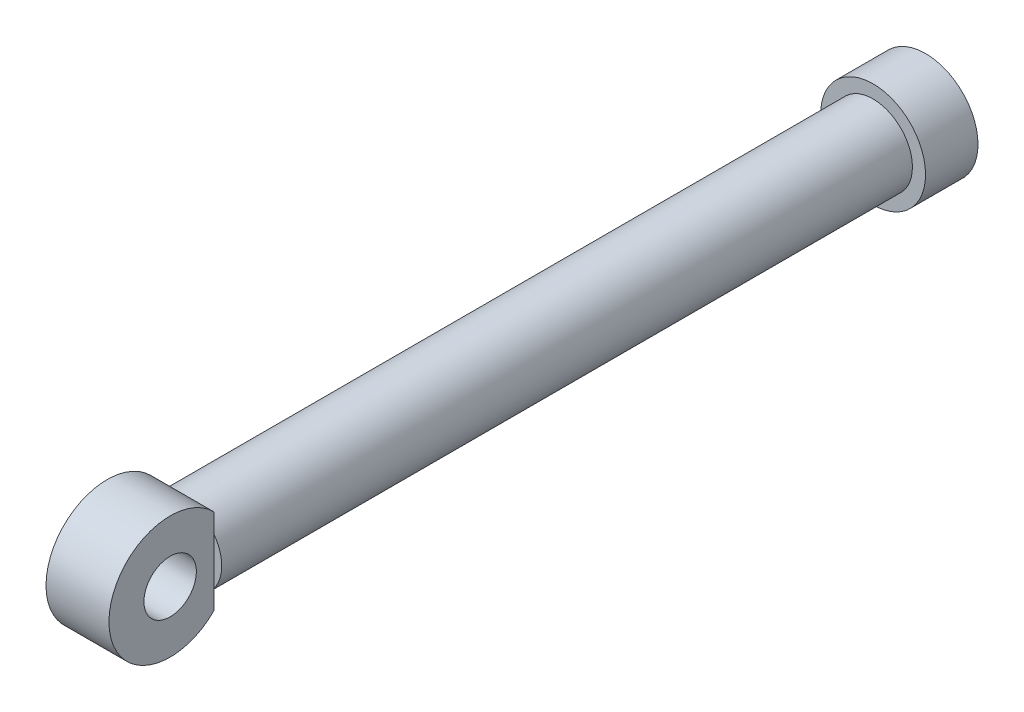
ISO-10303-21;
HEADER;
FILE_DESCRIPTION(('STEP AP214'),'2;1');
FILE_NAME('part.step','',(''),(''),'','','');
FILE_SCHEMA(('AUTOMOTIVE_DESIGN { 1 0 10303 214 1 1 1 1 }'));
ENDSEC;
DATA;
#1=APPLICATION_CONTEXT('core data for automotive mechanical design processes');
#2=APPLICATION_PROTOCOL_DEFINITION('international standard','automotive_design',2000,#1);
#3=PRODUCT_CONTEXT('',#1,'mechanical');
#4=PRODUCT('Part','Part','',(#3));
#5=PRODUCT_RELATED_PRODUCT_CATEGORY('part','',(#4));
#6=PRODUCT_DEFINITION_FORMATION('','',#4);
#7=PRODUCT_DEFINITION_CONTEXT('part definition',#1,'design');
#8=PRODUCT_DEFINITION('design','',#6,#7);
#9=PRODUCT_DEFINITION_SHAPE('','',#8);
#10=(LENGTH_UNIT() NAMED_UNIT(*) SI_UNIT(.MILLI.,.METRE.));
#11=(NAMED_UNIT(*) PLANE_ANGLE_UNIT() SI_UNIT($,.RADIAN.));
#12=(NAMED_UNIT(*) SI_UNIT($,.STERADIAN.) SOLID_ANGLE_UNIT());
#13=UNCERTAINTY_MEASURE_WITH_UNIT(LENGTH_MEASURE(1.E-05),#10,'distance_accuracy_value','');
#14=(GEOMETRIC_REPRESENTATION_CONTEXT(3) GLOBAL_UNCERTAINTY_ASSIGNED_CONTEXT((#13)) GLOBAL_UNIT_ASSIGNED_CONTEXT((#10,
#11,#12)) REPRESENTATION_CONTEXT('',''));
#15=CARTESIAN_POINT('',(0.,0.,0.));
#16=DIRECTION('',(0.,0.,1.));
#17=DIRECTION('',(1.,0.,0.));
#18=AXIS2_PLACEMENT_3D('',#15,#16,#17);
#19=CARTESIAN_POINT('',(0.,0.,425.));
#20=DIRECTION('',(0.,0.,1.));
#21=DIRECTION('',(1.,0.,0.));
#22=AXIS2_PLACEMENT_3D('',#19,#20,#21);
#23=PLANE('',#22);
#24=CARTESIAN_POINT('',(0.,0.,425.));
#25=DIRECTION('',(0.,0.,1.));
#26=DIRECTION('',(1.,0.,0.));
#27=AXIS2_PLACEMENT_3D('',#24,#25,#26);
#28=CIRCLE('',#27,22.5);
#29=CARTESIAN_POINT('',(-18.,13.5,425.));
#30=VERTEX_POINT('',#29);
#31=CARTESIAN_POINT('',(-18.,-13.5,425.));
#32=VERTEX_POINT('',#31);
#33=EDGE_CURVE('E117',#30,#32,#28,.T.);
#34=ORIENTED_EDGE('',*,*,#33,.T.);
#35=DIRECTION('',(0.,1.,0.));
#36=VECTOR('',#35,1.);
#37=CARTESIAN_POINT('',(-18.,0.,425.));
#38=LINE('',#37,#36);
#39=EDGE_CURVE('E47',#32,#30,#38,.T.);
#40=ORIENTED_EDGE('',*,*,#39,.T.);
#41=EDGE_LOOP('',(#34,#40));
#42=FACE_BOUND('',#41,.T.);
#43=ADVANCED_FACE('F39',(#42),#23,.T.);
#44=CARTESIAN_POINT('',(0.,0.,30.));
#45=DIRECTION('',(0.,0.,1.));
#46=DIRECTION('',(1.,0.,0.));
#47=AXIS2_PLACEMENT_3D('',#44,#45,#46);
#48=PLANE('',#47);
#49=CARTESIAN_POINT('',(0.,0.,30.));
#50=DIRECTION('',(0.,0.,1.));
#51=DIRECTION('',(1.,0.,0.));
#52=AXIS2_PLACEMENT_3D('',#49,#50,#51);
#53=CIRCLE('',#52,30.);
#54=CARTESIAN_POINT('',(30.,0.,30.));
#55=VERTEX_POINT('',#54);
#56=EDGE_CURVE('E120',#55,#55,#53,.T.);
#57=ORIENTED_EDGE('',*,*,#56,.T.);
#58=EDGE_LOOP('',(#57));
#59=FACE_BOUND('',#58,.T.);
#60=CARTESIAN_POINT('',(0.,0.,30.));
#61=DIRECTION('',(0.,0.,1.));
#62=DIRECTION('',(1.,0.,0.));
#63=AXIS2_PLACEMENT_3D('',#60,#61,#62);
#64=CIRCLE('',#63,22.5);
#65=CARTESIAN_POINT('',(22.5,0.,30.));
#66=VERTEX_POINT('',#65);
#67=EDGE_CURVE('E96',#66,#66,#64,.T.);
#68=ORIENTED_EDGE('',*,*,#67,.F.);
#69=EDGE_LOOP('',(#68));
#70=FACE_BOUND('',#69,.T.);
#71=ADVANCED_FACE('F149',(#59,#70),#48,.T.);
#72=CARTESIAN_POINT('',(0.,0.,30.));
#73=DIRECTION('',(0.,0.,-1.));
#74=DIRECTION('',(-1.,0.,0.));
#75=AXIS2_PLACEMENT_3D('',#72,#73,#74);
#76=CYLINDRICAL_SURFACE('',#75,30.);
#77=ORIENTED_EDGE('',*,*,#56,.F.);
#78=EDGE_LOOP('',(#77));
#79=FACE_BOUND('',#78,.T.);
#80=CARTESIAN_POINT('',(0.,0.,0.));
#81=DIRECTION('',(0.,0.,1.));
#82=DIRECTION('',(1.,0.,0.));
#83=AXIS2_PLACEMENT_3D('',#80,#81,#82);
#84=CIRCLE('',#83,30.);
#85=CARTESIAN_POINT('',(30.,0.,0.));
#86=VERTEX_POINT('',#85);
#87=EDGE_CURVE('E116',#86,#86,#84,.T.);
#88=ORIENTED_EDGE('',*,*,#87,.T.);
#89=EDGE_LOOP('',(#88));
#90=FACE_BOUND('',#89,.T.);
#91=ADVANCED_FACE('F41',(#79,#90),#76,.T.);
#92=CARTESIAN_POINT('',(0.,0.,0.));
#93=DIRECTION('',(0.,0.,1.));
#94=DIRECTION('',(1.,0.,0.));
#95=AXIS2_PLACEMENT_3D('',#92,#93,#94);
#96=PLANE('',#95);
#97=ORIENTED_EDGE('',*,*,#87,.F.);
#98=EDGE_LOOP('',(#97));
#99=FACE_BOUND('',#98,.T.);
#100=ADVANCED_FACE('F157',(#99),#96,.F.);
#101=CARTESIAN_POINT('',(0.,0.,425.));
#102=DIRECTION('',(0.,0.,-1.));
#103=DIRECTION('',(-1.,0.,0.));
#104=AXIS2_PLACEMENT_3D('',#101,#102,#103);
#105=CYLINDRICAL_SURFACE('',#104,22.5);
#106=CARTESIAN_POINT('',(18.,13.5,425.));
#107=VERTEX_POINT('',#106);
#108=EDGE_CURVE('E114',#107,#30,#28,.T.);
#109=ORIENTED_EDGE('',*,*,#108,.F.);
#110=CARTESIAN_POINT('',(18.,-13.5,425.));
#111=VERTEX_POINT('',#110);
#112=EDGE_CURVE('E113',#111,#107,#28,.T.);
#113=ORIENTED_EDGE('',*,*,#112,.F.);
#114=EDGE_CURVE('E130',#32,#111,#28,.T.);
#115=ORIENTED_EDGE('',*,*,#114,.F.);
#116=ORIENTED_EDGE('',*,*,#33,.F.);
#117=EDGE_LOOP('',(#109,#113,#115,#116));
#118=FACE_BOUND('',#117,.T.);
#119=ORIENTED_EDGE('',*,*,#67,.T.);
#120=EDGE_LOOP('',(#119));
#121=FACE_BOUND('',#120,.T.);
#122=ADVANCED_FACE('F127',(#118,#121),#105,.T.);
#123=DIRECTION('',(0.,1.,0.));
#124=VECTOR('',#123,1.);
#125=CARTESIAN_POINT('',(18.,0.,425.));
#126=LINE('',#125,#124);
#127=EDGE_CURVE('E11',#111,#107,#126,.T.);
#128=ORIENTED_EDGE('',*,*,#127,.F.);
#129=ORIENTED_EDGE('',*,*,#112,.T.);
#130=EDGE_LOOP('',(#128,#129));
#131=FACE_BOUND('',#130,.T.);
#132=ADVANCED_FACE('F134',(#131),#23,.T.);
#133=CARTESIAN_POINT('',(18.,24.4948974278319,425.));
#134=DIRECTION('',(0.,0.,1.));
#135=DIRECTION('',(1.,0.,0.));
#136=AXIS2_PLACEMENT_3D('',#133,#134,#135);
#137=PLANE('',#136);
#138=DIRECTION('',(0.,1.,0.));
#139=VECTOR('',#138,1.);
#140=CARTESIAN_POINT('',(18.,24.4948974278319,425.));
#141=LINE('',#140,#139);
#142=CARTESIAN_POINT('',(18.,24.4948974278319,425.));
#143=VERTEX_POINT('',#142);
#144=EDGE_CURVE('E61',#107,#143,#141,.T.);
#145=ORIENTED_EDGE('',*,*,#144,.F.);
#146=ORIENTED_EDGE('',*,*,#108,.T.);
#147=DIRECTION('',(0.,1.,0.));
#148=VECTOR('',#147,1.);
#149=CARTESIAN_POINT('',(-18.,24.4948974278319,425.));
#150=LINE('',#149,#148);
#151=CARTESIAN_POINT('',(-18.,24.4948974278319,425.));
#152=VERTEX_POINT('',#151);
#153=EDGE_CURVE('E54',#30,#152,#150,.T.);
#154=ORIENTED_EDGE('',*,*,#153,.T.);
#155=DIRECTION('',(-1.,0.,0.));
#156=VECTOR('',#155,1.);
#157=CARTESIAN_POINT('',(18.,24.4948974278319,425.));
#158=LINE('',#157,#156);
#159=EDGE_CURVE('E97',#143,#152,#158,.T.);
#160=ORIENTED_EDGE('',*,*,#159,.F.);
#161=EDGE_LOOP('',(#145,#146,#154,#160));
#162=FACE_BOUND('',#161,.T.);
#163=ADVANCED_FACE('F138',(#162),#137,.F.);
#164=CARTESIAN_POINT('',(-18.,-24.4948974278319,425.));
#165=VERTEX_POINT('',#164);
#166=EDGE_CURVE('E77',#165,#32,#150,.T.);
#167=ORIENTED_EDGE('',*,*,#166,.T.);
#168=ORIENTED_EDGE('',*,*,#114,.T.);
#169=CARTESIAN_POINT('',(18.,-24.4948974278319,425.));
#170=VERTEX_POINT('',#169);
#171=EDGE_CURVE('E92',#170,#111,#141,.T.);
#172=ORIENTED_EDGE('',*,*,#171,.F.);
#173=DIRECTION('',(-1.,0.,0.));
#174=VECTOR('',#173,1.);
#175=CARTESIAN_POINT('',(18.,-24.4948974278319,425.));
#176=LINE('',#175,#174);
#177=EDGE_CURVE('E89',#170,#165,#176,.T.);
#178=ORIENTED_EDGE('',*,*,#177,.T.);
#179=EDGE_LOOP('',(#167,#168,#172,#178));
#180=FACE_BOUND('',#179,.T.);
#181=ADVANCED_FACE('F90',(#180),#137,.F.);
#182=CARTESIAN_POINT('',(18.,0.,450.));
#183=DIRECTION('',(1.,0.,0.));
#184=DIRECTION('',(0.,0.,-1.));
#185=AXIS2_PLACEMENT_3D('',#182,#183,#184);
#186=PLANE('',#185);
#187=CARTESIAN_POINT('',(18.,0.,450.));
#188=DIRECTION('',(1.,0.,0.));
#189=DIRECTION('',(0.,0.,-1.));
#190=AXIS2_PLACEMENT_3D('',#187,#188,#189);
#191=CIRCLE('',#190,35.);
#192=EDGE_CURVE('E86',#143,#170,#191,.T.);
#193=ORIENTED_EDGE('',*,*,#192,.T.);
#194=ORIENTED_EDGE('',*,*,#171,.T.);
#195=ORIENTED_EDGE('',*,*,#127,.T.);
#196=ORIENTED_EDGE('',*,*,#144,.T.);
#197=EDGE_LOOP('',(#193,#194,#195,#196));
#198=FACE_BOUND('',#197,.T.);
#199=CARTESIAN_POINT('',(18.,0.,450.));
#200=DIRECTION('',(1.,0.,0.));
#201=DIRECTION('',(0.,0.,-1.));
#202=AXIS2_PLACEMENT_3D('',#199,#200,#201);
#203=CIRCLE('',#202,15.);
#204=CARTESIAN_POINT('',(18.,0.,435.));
#205=VERTEX_POINT('',#204);
#206=EDGE_CURVE('E101',#205,#205,#203,.T.);
#207=ORIENTED_EDGE('',*,*,#206,.F.);
#208=EDGE_LOOP('',(#207));
#209=FACE_BOUND('',#208,.T.);
#210=ADVANCED_FACE('F136',(#198,#209),#186,.T.);
#211=CARTESIAN_POINT('',(-18.,0.,450.));
#212=DIRECTION('',(1.,0.,0.));
#213=DIRECTION('',(0.,0.,-1.));
#214=AXIS2_PLACEMENT_3D('',#211,#212,#213);
#215=PLANE('',#214);
#216=CARTESIAN_POINT('',(-18.,0.,450.));
#217=DIRECTION('',(1.,0.,0.));
#218=DIRECTION('',(0.,0.,-1.));
#219=AXIS2_PLACEMENT_3D('',#216,#217,#218);
#220=CIRCLE('',#219,35.);
#221=EDGE_CURVE('E82',#152,#165,#220,.T.);
#222=ORIENTED_EDGE('',*,*,#221,.F.);
#223=ORIENTED_EDGE('',*,*,#153,.F.);
#224=ORIENTED_EDGE('',*,*,#39,.F.);
#225=ORIENTED_EDGE('',*,*,#166,.F.);
#226=EDGE_LOOP('',(#222,#223,#224,#225));
#227=FACE_BOUND('',#226,.T.);
#228=CARTESIAN_POINT('',(-18.,0.,450.));
#229=DIRECTION('',(1.,0.,0.));
#230=DIRECTION('',(0.,0.,-1.));
#231=AXIS2_PLACEMENT_3D('',#228,#229,#230);
#232=CIRCLE('',#231,15.);
#233=CARTESIAN_POINT('',(-18.,0.,435.));
#234=VERTEX_POINT('',#233);
#235=EDGE_CURVE('E104',#234,#234,#232,.T.);
#236=ORIENTED_EDGE('',*,*,#235,.T.);
#237=EDGE_LOOP('',(#236));
#238=FACE_BOUND('',#237,.T.);
#239=ADVANCED_FACE('F79',(#227,#238),#215,.F.);
#240=CARTESIAN_POINT('',(18.,0.,450.));
#241=DIRECTION('',(-1.,0.,0.));
#242=DIRECTION('',(0.,0.,1.));
#243=AXIS2_PLACEMENT_3D('',#240,#241,#242);
#244=CYLINDRICAL_SURFACE('',#243,35.);
#245=ORIENTED_EDGE('',*,*,#221,.T.);
#246=ORIENTED_EDGE('',*,*,#177,.F.);
#247=ORIENTED_EDGE('',*,*,#192,.F.);
#248=ORIENTED_EDGE('',*,*,#159,.T.);
#249=EDGE_LOOP('',(#245,#246,#247,#248));
#250=FACE_BOUND('',#249,.T.);
#251=ADVANCED_FACE('F100',(#250),#244,.T.);
#252=CARTESIAN_POINT('',(18.,0.,450.));
#253=DIRECTION('',(-1.,0.,0.));
#254=DIRECTION('',(0.,0.,1.));
#255=AXIS2_PLACEMENT_3D('',#252,#253,#254);
#256=CYLINDRICAL_SURFACE('',#255,15.);
#257=ORIENTED_EDGE('',*,*,#206,.T.);
#258=EDGE_LOOP('',(#257));
#259=FACE_BOUND('',#258,.T.);
#260=ORIENTED_EDGE('',*,*,#235,.F.);
#261=EDGE_LOOP('',(#260));
#262=FACE_BOUND('',#261,.T.);
#263=ADVANCED_FACE('F211',(#259,#262),#256,.F.);
#264=CLOSED_SHELL('',(#43,#71,#91,#100,#122,#132,#163,#181,#210,#239,#251,#263));
#265=MANIFOLD_SOLID_BREP('B2',#264);
#266=ADVANCED_BREP_SHAPE_REPRESENTATION('',(#18,#265),#14);
#267=SHAPE_DEFINITION_REPRESENTATION(#9,#266);
ENDSEC;
END-ISO-10303-21;
